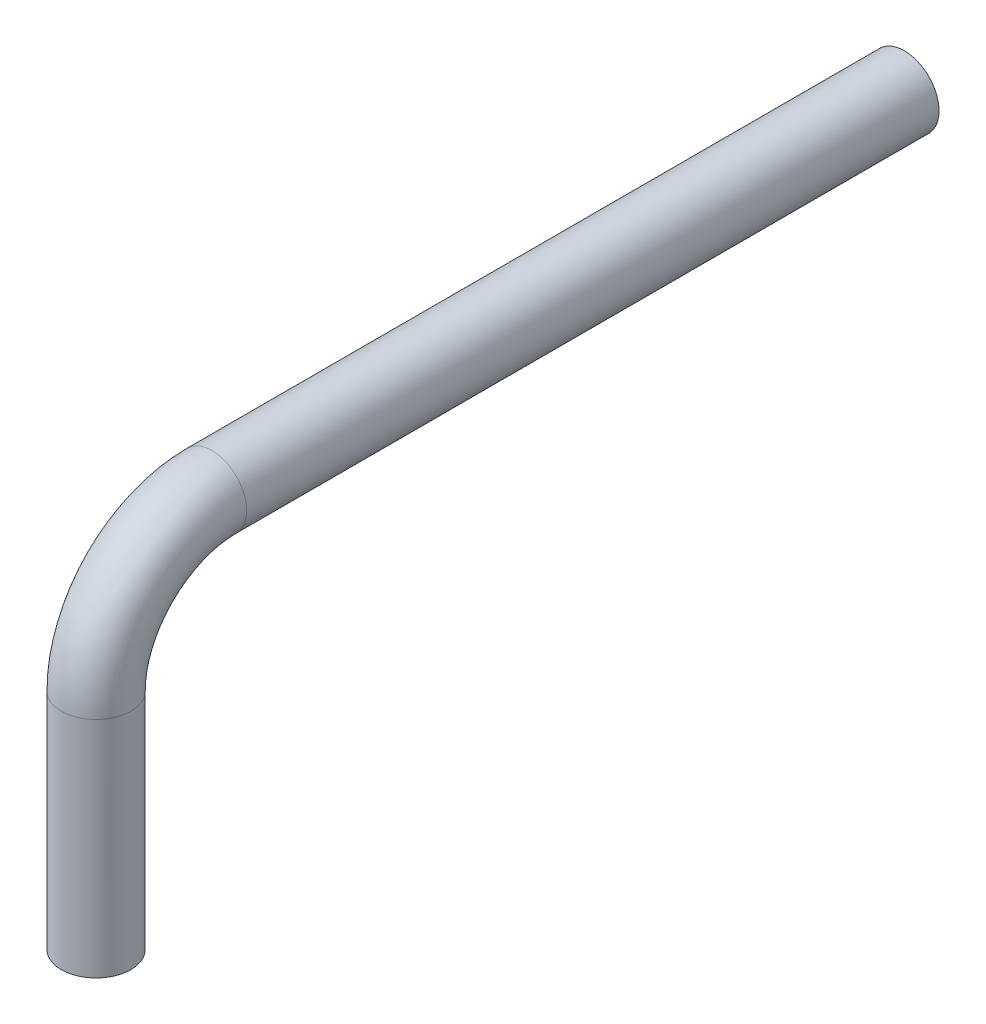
from build123d import *

# Parameters (mm, degrees)
SKETCH1_R          = 0.762
BASE_EXTRUDE_DEPTH = 12.7
SKETCH2_R          = 0.762


with BuildPart() as part:
    # Sketch1 → Base-Extrude (new body)
    with BuildSketch(Plane.XY):
        with Locations(Location((0, 0, 0), (0, 0, 90))):
            Circle(SKETCH1_R)
    extrude(amount=BASE_EXTRUDE_DEPTH)

    # Boss-Sweep1: sweep along a path in Sketch3
    with BuildLine(Plane(origin=(0, 0, 0), x_dir=(0, 0, -1), z_dir=(1, 0, 0))) as boss_sweep1_path:
        Line((-12.7, 0), (-15.187061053, 0))
        ThreePointArc((-15.187061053, 0), (-16.983112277, -0.743948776), (-17.727061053, -2.54))
        Line((-17.727061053, -2.54), (-17.727061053, -7.449953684))
    # Sketch2 → Boss-Sweep1 (sweep)
    with BuildSketch(Plane.XY.offset(12.7)):
        Circle(SKETCH2_R)
    sweep(path=boss_sweep1_path.line)


solid = part.part
